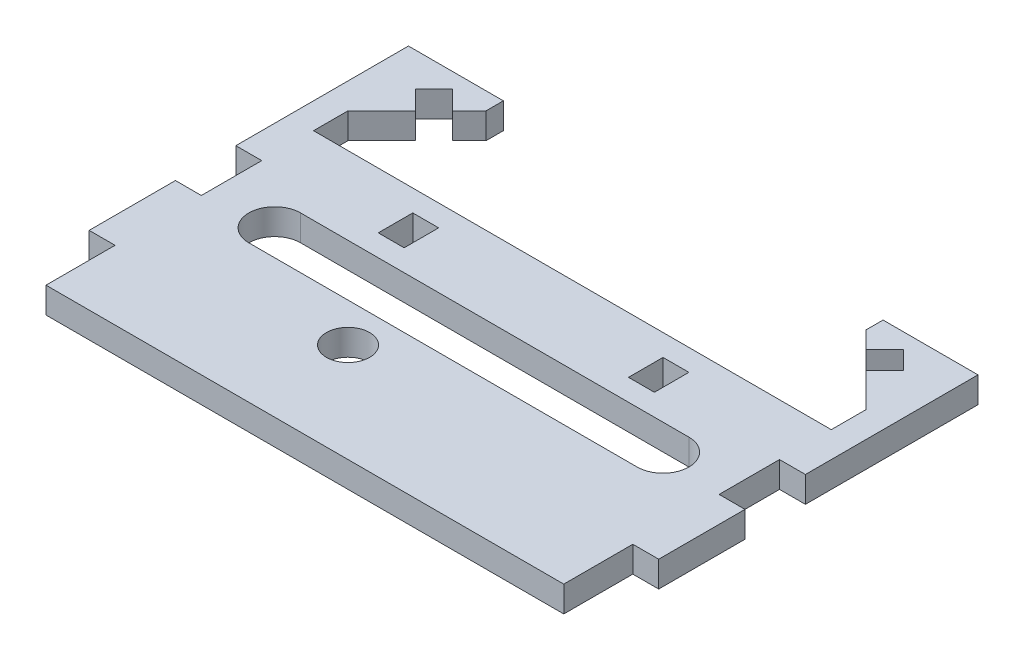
ISO-10303-21;
HEADER;
FILE_DESCRIPTION(('STEP AP214'),'2;1');
FILE_NAME('part.step','',(''),(''),'','','');
FILE_SCHEMA(('AUTOMOTIVE_DESIGN { 1 0 10303 214 1 1 1 1 }'));
ENDSEC;
DATA;
#1=APPLICATION_CONTEXT('core data for automotive mechanical design processes');
#2=APPLICATION_PROTOCOL_DEFINITION('international standard','automotive_design',2000,#1);
#3=PRODUCT_CONTEXT('',#1,'mechanical');
#4=PRODUCT('Part','Part','',(#3));
#5=PRODUCT_RELATED_PRODUCT_CATEGORY('part','',(#4));
#6=PRODUCT_DEFINITION_FORMATION('','',#4);
#7=PRODUCT_DEFINITION_CONTEXT('part definition',#1,'design');
#8=PRODUCT_DEFINITION('design','',#6,#7);
#9=PRODUCT_DEFINITION_SHAPE('','',#8);
#10=(LENGTH_UNIT() NAMED_UNIT(*) SI_UNIT(.MILLI.,.METRE.));
#11=(NAMED_UNIT(*) PLANE_ANGLE_UNIT() SI_UNIT($,.RADIAN.));
#12=(NAMED_UNIT(*) SI_UNIT($,.STERADIAN.) SOLID_ANGLE_UNIT());
#13=UNCERTAINTY_MEASURE_WITH_UNIT(LENGTH_MEASURE(1.E-05),#10,'distance_accuracy_value','');
#14=(GEOMETRIC_REPRESENTATION_CONTEXT(3) GLOBAL_UNCERTAINTY_ASSIGNED_CONTEXT((#13)) GLOBAL_UNIT_ASSIGNED_CONTEXT((#10,
#11,#12)) REPRESENTATION_CONTEXT('',''));
#15=CARTESIAN_POINT('',(0.,0.,0.));
#16=DIRECTION('',(0.,0.,1.));
#17=DIRECTION('',(1.,0.,0.));
#18=AXIS2_PLACEMENT_3D('',#15,#16,#17);
#19=CARTESIAN_POINT('',(30.,3.,18.));
#20=DIRECTION('',(0.,1.,0.));
#21=DIRECTION('',(0.,0.,1.));
#22=AXIS2_PLACEMENT_3D('',#19,#20,#21);
#23=PLANE('',#22);
#24=DIRECTION('',(-1.,0.,0.));
#25=VECTOR('',#24,1.);
#26=CARTESIAN_POINT('',(13.,3.,-10.5));
#27=LINE('',#26,#25);
#28=CARTESIAN_POINT('',(16.,3.,-10.5));
#29=VERTEX_POINT('',#28);
#30=CARTESIAN_POINT('',(13.,3.,-10.5));
#31=VERTEX_POINT('',#30);
#32=EDGE_CURVE('E355',#29,#31,#27,.T.);
#33=ORIENTED_EDGE('',*,*,#32,.F.);
#34=DIRECTION('',(0.,0.,-1.));
#35=VECTOR('',#34,1.);
#36=CARTESIAN_POINT('',(16.,3.,-10.5));
#37=LINE('',#36,#35);
#38=CARTESIAN_POINT('',(16.,3.,-6.50000000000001));
#39=VERTEX_POINT('',#38);
#40=EDGE_CURVE('E358',#39,#29,#37,.T.);
#41=ORIENTED_EDGE('',*,*,#40,.F.);
#42=DIRECTION('',(1.,0.,0.));
#43=VECTOR('',#42,1.);
#44=CARTESIAN_POINT('',(13.,3.,-6.50000000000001));
#45=LINE('',#44,#43);
#46=CARTESIAN_POINT('',(13.,3.,-6.50000000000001));
#47=VERTEX_POINT('',#46);
#48=EDGE_CURVE('E382',#47,#39,#45,.T.);
#49=ORIENTED_EDGE('',*,*,#48,.F.);
#50=DIRECTION('',(0.,0.,1.));
#51=VECTOR('',#50,1.);
#52=CARTESIAN_POINT('',(13.,3.,-10.5));
#53=LINE('',#52,#51);
#54=EDGE_CURVE('E333',#31,#47,#53,.T.);
#55=ORIENTED_EDGE('',*,*,#54,.F.);
#56=EDGE_LOOP('',(#33,#41,#49,#55));
#57=FACE_BOUND('',#56,.T.);
#58=DIRECTION('',(-0.707106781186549,0.,-0.707106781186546));
#59=VECTOR('',#58,1.);
#60=CARTESIAN_POINT('',(28.2731493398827,3.,-23.1109127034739));
#61=LINE('',#60,#59);
#62=CARTESIAN_POINT('',(28.2731493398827,3.,-23.1109127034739));
#63=VERTEX_POINT('',#62);
#64=CARTESIAN_POINT('',(26.151828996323,3.,-25.2322330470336));
#65=VERTEX_POINT('',#64);
#66=EDGE_CURVE('E420',#63,#65,#61,.T.);
#67=ORIENTED_EDGE('',*,*,#66,.F.);
#68=DIRECTION('',(0.707106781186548,0.,-0.707106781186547));
#69=VECTOR('',#68,1.);
#70=CARTESIAN_POINT('',(28.2731493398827,3.,-23.1109127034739));
#71=LINE('',#70,#69);
#72=CARTESIAN_POINT('',(26.0811183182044,3.,-20.9188816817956));
#73=VERTEX_POINT('',#72);
#74=EDGE_CURVE('E418',#73,#63,#71,.T.);
#75=ORIENTED_EDGE('',*,*,#74,.F.);
#76=DIRECTION('',(0.707106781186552,0.,0.707106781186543));
#77=VECTOR('',#76,1.);
#78=CARTESIAN_POINT('',(22.,3.,-24.9999999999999));
#79=LINE('',#78,#77);
#80=CARTESIAN_POINT('',(30.,3.,-17.));
#81=VERTEX_POINT('',#80);
#82=EDGE_CURVE('E478',#73,#81,#79,.T.);
#83=ORIENTED_EDGE('',*,*,#82,.T.);
#84=DIRECTION('',(0.,0.,1.));
#85=VECTOR('',#84,1.);
#86=CARTESIAN_POINT('',(30.,3.,-17.));
#87=LINE('',#86,#85);
#88=CARTESIAN_POINT('',(30.,3.,-13.));
#89=VERTEX_POINT('',#88);
#90=EDGE_CURVE('E482',#81,#89,#87,.T.);
#91=ORIENTED_EDGE('',*,*,#90,.T.);
#92=DIRECTION('',(1.,0.,0.));
#93=VECTOR('',#92,1.);
#94=CARTESIAN_POINT('',(-30.,3.,-13.));
#95=LINE('',#94,#93);
#96=CARTESIAN_POINT('',(-30.,3.,-13.));
#97=VERTEX_POINT('',#96);
#98=EDGE_CURVE('E563',#97,#89,#95,.T.);
#99=ORIENTED_EDGE('',*,*,#98,.F.);
#100=DIRECTION('',(0.,0.,-1.));
#101=VECTOR('',#100,1.);
#102=CARTESIAN_POINT('',(-30.,3.,-7.));
#103=LINE('',#102,#101);
#104=CARTESIAN_POINT('',(-30.,3.,-17.));
#105=VERTEX_POINT('',#104);
#106=EDGE_CURVE('E519',#97,#105,#103,.T.);
#107=ORIENTED_EDGE('',*,*,#106,.T.);
#108=DIRECTION('',(0.707106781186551,0.,-0.707106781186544));
#109=VECTOR('',#108,1.);
#110=CARTESIAN_POINT('',(-22.,3.,-24.9999999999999));
#111=LINE('',#110,#109);
#112=CARTESIAN_POINT('',(-26.0811183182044,3.,-20.9188816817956));
#113=VERTEX_POINT('',#112);
#114=EDGE_CURVE('E523',#105,#113,#111,.T.);
#115=ORIENTED_EDGE('',*,*,#114,.T.);
#116=DIRECTION('',(0.707106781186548,0.,0.707106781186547));
#117=VECTOR('',#116,1.);
#118=CARTESIAN_POINT('',(-28.2731493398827,3.,-23.1109127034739));
#119=LINE('',#118,#117);
#120=CARTESIAN_POINT('',(-28.2731493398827,3.,-23.1109127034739));
#121=VERTEX_POINT('',#120);
#122=EDGE_CURVE('E445',#121,#113,#119,.T.);
#123=ORIENTED_EDGE('',*,*,#122,.F.);
#124=DIRECTION('',(-0.707106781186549,0.,0.707106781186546));
#125=VECTOR('',#124,1.);
#126=CARTESIAN_POINT('',(-28.2731493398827,3.,-23.1109127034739));
#127=LINE('',#126,#125);
#128=CARTESIAN_POINT('',(-26.151828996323,3.,-25.2322330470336));
#129=VERTEX_POINT('',#128);
#130=EDGE_CURVE('E443',#129,#121,#127,.T.);
#131=ORIENTED_EDGE('',*,*,#130,.F.);
#132=DIRECTION('',(-0.707106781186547,0.,-0.707106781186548));
#133=VECTOR('',#132,1.);
#134=CARTESIAN_POINT('',(-26.151828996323,3.,-25.2322330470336));
#135=LINE('',#134,#133);
#136=CARTESIAN_POINT('',(-23.9597979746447,3.,-23.0402020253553));
#137=VERTEX_POINT('',#136);
#138=EDGE_CURVE('E448',#137,#129,#135,.T.);
#139=ORIENTED_EDGE('',*,*,#138,.F.);
#140=CARTESIAN_POINT('',(-22.,3.,-24.9999999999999));
#141=VERTEX_POINT('',#140);
#142=EDGE_CURVE('E522',#137,#141,#111,.T.);
#143=ORIENTED_EDGE('',*,*,#142,.T.);
#144=DIRECTION('',(0.,0.,-1.));
#145=VECTOR('',#144,1.);
#146=CARTESIAN_POINT('',(-22.,3.,-26.9999999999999));
#147=LINE('',#146,#145);
#148=CARTESIAN_POINT('',(-22.,3.,-26.9999999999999));
#149=VERTEX_POINT('',#148);
#150=EDGE_CURVE('E526',#141,#149,#147,.T.);
#151=ORIENTED_EDGE('',*,*,#150,.T.);
#152=DIRECTION('',(-1.,0.,0.));
#153=VECTOR('',#152,1.);
#154=CARTESIAN_POINT('',(-33.,3.,-26.9999999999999));
#155=LINE('',#154,#153);
#156=CARTESIAN_POINT('',(-33.,3.,-26.9999999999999));
#157=VERTEX_POINT('',#156);
#158=EDGE_CURVE('E528',#149,#157,#155,.T.);
#159=ORIENTED_EDGE('',*,*,#158,.T.);
#160=DIRECTION('',(0.,0.,1.));
#161=VECTOR('',#160,1.);
#162=CARTESIAN_POINT('',(-33.,3.,-7.));
#163=LINE('',#162,#161);
#164=CARTESIAN_POINT('',(-33.,3.,-7.));
#165=VERTEX_POINT('',#164);
#166=EDGE_CURVE('E530',#157,#165,#163,.T.);
#167=ORIENTED_EDGE('',*,*,#166,.T.);
#168=DIRECTION('',(1.,0.,0.));
#169=VECTOR('',#168,1.);
#170=CARTESIAN_POINT('',(-33.,3.,-7.));
#171=LINE('',#170,#169);
#172=CARTESIAN_POINT('',(-30.,3.,-7.00000000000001));
#173=VERTEX_POINT('',#172);
#174=EDGE_CURVE('E516',#165,#173,#171,.T.);
#175=ORIENTED_EDGE('',*,*,#174,.T.);
#176=DIRECTION('',(0.,0.,1.));
#177=VECTOR('',#176,1.);
#178=CARTESIAN_POINT('',(-30.,3.,-18.));
#179=LINE('',#178,#177);
#180=CARTESIAN_POINT('',(-30.,3.,0.));
#181=VERTEX_POINT('',#180);
#182=EDGE_CURVE('E39',#173,#181,#179,.T.);
#183=ORIENTED_EDGE('',*,*,#182,.T.);
#184=DIRECTION('',(-1.,0.,0.));
#185=VECTOR('',#184,1.);
#186=CARTESIAN_POINT('',(-33.,3.,0.));
#187=LINE('',#186,#185);
#188=CARTESIAN_POINT('',(-33.,3.,0.));
#189=VERTEX_POINT('',#188);
#190=EDGE_CURVE('E637',#181,#189,#187,.T.);
#191=ORIENTED_EDGE('',*,*,#190,.T.);
#192=DIRECTION('',(0.,0.,1.));
#193=VECTOR('',#192,1.);
#194=CARTESIAN_POINT('',(-33.,3.,0.));
#195=LINE('',#194,#193);
#196=CARTESIAN_POINT('',(-33.,3.,10.));
#197=VERTEX_POINT('',#196);
#198=EDGE_CURVE('E650',#189,#197,#195,.T.);
#199=ORIENTED_EDGE('',*,*,#198,.T.);
#200=DIRECTION('',(1.,0.,0.));
#201=VECTOR('',#200,1.);
#202=CARTESIAN_POINT('',(-33.,3.,10.));
#203=LINE('',#202,#201);
#204=CARTESIAN_POINT('',(-30.,3.,10.));
#205=VERTEX_POINT('',#204);
#206=EDGE_CURVE('E796',#197,#205,#203,.T.);
#207=ORIENTED_EDGE('',*,*,#206,.T.);
#208=CARTESIAN_POINT('',(-30.,3.,18.));
#209=VERTEX_POINT('',#208);
#210=EDGE_CURVE('E617',#205,#209,#179,.T.);
#211=ORIENTED_EDGE('',*,*,#210,.T.);
#212=DIRECTION('',(1.,0.,0.));
#213=VECTOR('',#212,1.);
#214=CARTESIAN_POINT('',(-30.,3.,18.));
#215=LINE('',#214,#213);
#216=CARTESIAN_POINT('',(30.,3.,18.));
#217=VERTEX_POINT('',#216);
#218=EDGE_CURVE('E627',#209,#217,#215,.T.);
#219=ORIENTED_EDGE('',*,*,#218,.T.);
#220=DIRECTION('',(0.,0.,-1.));
#221=VECTOR('',#220,1.);
#222=CARTESIAN_POINT('',(30.,3.,-18.));
#223=LINE('',#222,#221);
#224=CARTESIAN_POINT('',(30.,3.,10.));
#225=VERTEX_POINT('',#224);
#226=EDGE_CURVE('E619',#217,#225,#223,.T.);
#227=ORIENTED_EDGE('',*,*,#226,.T.);
#228=DIRECTION('',(1.,0.,0.));
#229=VECTOR('',#228,1.);
#230=CARTESIAN_POINT('',(33.,3.,10.));
#231=LINE('',#230,#229);
#232=CARTESIAN_POINT('',(33.,3.,10.));
#233=VERTEX_POINT('',#232);
#234=EDGE_CURVE('E587',#225,#233,#231,.T.);
#235=ORIENTED_EDGE('',*,*,#234,.T.);
#236=DIRECTION('',(0.,0.,-1.));
#237=VECTOR('',#236,1.);
#238=CARTESIAN_POINT('',(33.,3.,0.));
#239=LINE('',#238,#237);
#240=CARTESIAN_POINT('',(33.,3.,0.));
#241=VERTEX_POINT('',#240);
#242=EDGE_CURVE('E575',#233,#241,#239,.T.);
#243=ORIENTED_EDGE('',*,*,#242,.T.);
#244=DIRECTION('',(-1.,0.,0.));
#245=VECTOR('',#244,1.);
#246=CARTESIAN_POINT('',(33.,3.,0.));
#247=LINE('',#246,#245);
#248=CARTESIAN_POINT('',(30.,3.,0.));
#249=VERTEX_POINT('',#248);
#250=EDGE_CURVE('E578',#241,#249,#247,.T.);
#251=ORIENTED_EDGE('',*,*,#250,.T.);
#252=CARTESIAN_POINT('',(30.,3.,-7.));
#253=VERTEX_POINT('',#252);
#254=EDGE_CURVE('E685',#249,#253,#223,.T.);
#255=ORIENTED_EDGE('',*,*,#254,.T.);
#256=DIRECTION('',(1.,0.,0.));
#257=VECTOR('',#256,1.);
#258=CARTESIAN_POINT('',(33.,3.,-7.));
#259=LINE('',#258,#257);
#260=CARTESIAN_POINT('',(33.,3.,-7.));
#261=VERTEX_POINT('',#260);
#262=EDGE_CURVE('E468',#253,#261,#259,.T.);
#263=ORIENTED_EDGE('',*,*,#262,.T.);
#264=DIRECTION('',(0.,0.,-1.));
#265=VECTOR('',#264,1.);
#266=CARTESIAN_POINT('',(33.,3.,-7.));
#267=LINE('',#266,#265);
#268=CARTESIAN_POINT('',(33.,3.,-26.9999999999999));
#269=VERTEX_POINT('',#268);
#270=EDGE_CURVE('E471',#261,#269,#267,.T.);
#271=ORIENTED_EDGE('',*,*,#270,.T.);
#272=DIRECTION('',(-1.,0.,0.));
#273=VECTOR('',#272,1.);
#274=CARTESIAN_POINT('',(33.,3.,-26.9999999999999));
#275=LINE('',#274,#273);
#276=CARTESIAN_POINT('',(22.,3.,-26.9999999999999));
#277=VERTEX_POINT('',#276);
#278=EDGE_CURVE('E474',#269,#277,#275,.T.);
#279=ORIENTED_EDGE('',*,*,#278,.T.);
#280=DIRECTION('',(0.,0.,1.));
#281=VECTOR('',#280,1.);
#282=CARTESIAN_POINT('',(22.,3.,-26.9999999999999));
#283=LINE('',#282,#281);
#284=CARTESIAN_POINT('',(22.,3.,-24.9999999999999));
#285=VERTEX_POINT('',#284);
#286=EDGE_CURVE('E476',#277,#285,#283,.T.);
#287=ORIENTED_EDGE('',*,*,#286,.T.);
#288=CARTESIAN_POINT('',(23.9597979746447,3.,-23.0402020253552));
#289=VERTEX_POINT('',#288);
#290=EDGE_CURVE('E479',#285,#289,#79,.T.);
#291=ORIENTED_EDGE('',*,*,#290,.T.);
#292=DIRECTION('',(-0.707106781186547,0.,0.707106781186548));
#293=VECTOR('',#292,1.);
#294=CARTESIAN_POINT('',(26.151828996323,3.,-25.2322330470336));
#295=LINE('',#294,#293);
#296=EDGE_CURVE('E423',#65,#289,#295,.T.);
#297=ORIENTED_EDGE('',*,*,#296,.F.);
#298=EDGE_LOOP('',(#67,#75,#83,#91,#99,#107,#115,#123,#131,#139,#143,#151,#159,#167,#175,#183,
#191,#199,#207,#211,#219,#227,#235,#243,#251,#255,#263,#271,#279,#287,#291,#297));
#299=FACE_BOUND('',#298,.T.);
#300=CARTESIAN_POINT('',(-6.5,3.,6.5));
#301=DIRECTION('',(0.,1.,0.));
#302=DIRECTION('',(0.,0.,1.));
#303=AXIS2_PLACEMENT_3D('',#300,#301,#302);
#304=CIRCLE('',#303,2.5);
#305=CARTESIAN_POINT('',(-6.5,3.,9.));
#306=VERTEX_POINT('',#305);
#307=EDGE_CURVE('E659',#306,#306,#304,.T.);
#308=ORIENTED_EDGE('',*,*,#307,.F.);
#309=EDGE_LOOP('',(#308));
#310=FACE_BOUND('',#309,.T.);
#311=DIRECTION('',(1.,0.,0.));
#312=VECTOR('',#311,1.);
#313=CARTESIAN_POINT('',(-22.5,3.,1.99999999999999));
#314=LINE('',#313,#312);
#315=CARTESIAN_POINT('',(-22.5,3.,1.99999999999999));
#316=VERTEX_POINT('',#315);
#317=CARTESIAN_POINT('',(22.5,3.,1.99999999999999));
#318=VERTEX_POINT('',#317);
#319=EDGE_CURVE('E387',#316,#318,#314,.T.);
#320=ORIENTED_EDGE('',*,*,#319,.F.);
#321=CARTESIAN_POINT('',(-22.5,3.,-1.00000000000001));
#322=DIRECTION('',(0.,1.,0.));
#323=DIRECTION('',(0.,0.,1.));
#324=AXIS2_PLACEMENT_3D('',#321,#322,#323);
#325=CIRCLE('',#324,3.);
#326=CARTESIAN_POINT('',(-22.5,3.,-4.00000000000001));
#327=VERTEX_POINT('',#326);
#328=EDGE_CURVE('E390',#327,#316,#325,.T.);
#329=ORIENTED_EDGE('',*,*,#328,.F.);
#330=DIRECTION('',(-1.,0.,0.));
#331=VECTOR('',#330,1.);
#332=CARTESIAN_POINT('',(-22.5,3.,-4.00000000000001));
#333=LINE('',#332,#331);
#334=CARTESIAN_POINT('',(22.5,3.,-4.00000000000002));
#335=VERTEX_POINT('',#334);
#336=EDGE_CURVE('E414',#335,#327,#333,.T.);
#337=ORIENTED_EDGE('',*,*,#336,.F.);
#338=CARTESIAN_POINT('',(22.5,3.,-1.00000000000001));
#339=DIRECTION('',(0.,1.,0.));
#340=DIRECTION('',(0.,0.,1.));
#341=AXIS2_PLACEMENT_3D('',#338,#339,#340);
#342=CIRCLE('',#341,3.);
#343=EDGE_CURVE('E385',#318,#335,#342,.T.);
#344=ORIENTED_EDGE('',*,*,#343,.F.);
#345=EDGE_LOOP('',(#320,#329,#337,#344));
#346=FACE_BOUND('',#345,.T.);
#347=DIRECTION('',(-1.,0.,0.));
#348=VECTOR('',#347,1.);
#349=CARTESIAN_POINT('',(-16.,3.,-10.5));
#350=LINE('',#349,#348);
#351=CARTESIAN_POINT('',(-13.,3.,-10.5));
#352=VERTEX_POINT('',#351);
#353=CARTESIAN_POINT('',(-16.,3.,-10.5));
#354=VERTEX_POINT('',#353);
#355=EDGE_CURVE('E337',#352,#354,#350,.T.);
#356=ORIENTED_EDGE('',*,*,#355,.F.);
#357=DIRECTION('',(0.,0.,-1.));
#358=VECTOR('',#357,1.);
#359=CARTESIAN_POINT('',(-13.,3.,-10.5));
#360=LINE('',#359,#358);
#361=CARTESIAN_POINT('',(-13.,3.,-6.50000000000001));
#362=VERTEX_POINT('',#361);
#363=EDGE_CURVE('E321',#362,#352,#360,.T.);
#364=ORIENTED_EDGE('',*,*,#363,.F.);
#365=DIRECTION('',(1.,0.,0.));
#366=VECTOR('',#365,1.);
#367=CARTESIAN_POINT('',(-16.,3.,-6.50000000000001));
#368=LINE('',#367,#366);
#369=CARTESIAN_POINT('',(-16.,3.,-6.50000000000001));
#370=VERTEX_POINT('',#369);
#371=EDGE_CURVE('E330',#370,#362,#368,.T.);
#372=ORIENTED_EDGE('',*,*,#371,.F.);
#373=DIRECTION('',(0.,0.,1.));
#374=VECTOR('',#373,1.);
#375=CARTESIAN_POINT('',(-16.,3.,-10.5));
#376=LINE('',#375,#374);
#377=EDGE_CURVE('E53',#354,#370,#376,.T.);
#378=ORIENTED_EDGE('',*,*,#377,.F.);
#379=EDGE_LOOP('',(#356,#364,#372,#378));
#380=FACE_BOUND('',#379,.T.);
#381=ADVANCED_FACE('F35',(#57,#299,#310,#346,#380),#23,.T.);
#382=CARTESIAN_POINT('',(30.,0.,18.));
#383=DIRECTION('',(0.,1.,0.));
#384=DIRECTION('',(0.,0.,1.));
#385=AXIS2_PLACEMENT_3D('',#382,#383,#384);
#386=PLANE('',#385);
#387=DIRECTION('',(0.,0.,-1.));
#388=VECTOR('',#387,1.);
#389=CARTESIAN_POINT('',(16.,0.,-10.5));
#390=LINE('',#389,#388);
#391=CARTESIAN_POINT('',(16.,0.,-6.50000000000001));
#392=VERTEX_POINT('',#391);
#393=CARTESIAN_POINT('',(16.,0.,-10.5));
#394=VERTEX_POINT('',#393);
#395=EDGE_CURVE('E361',#392,#394,#390,.T.);
#396=ORIENTED_EDGE('',*,*,#395,.T.);
#397=DIRECTION('',(-1.,0.,0.));
#398=VECTOR('',#397,1.);
#399=CARTESIAN_POINT('',(13.,0.,-10.5));
#400=LINE('',#399,#398);
#401=CARTESIAN_POINT('',(13.,0.,-10.5));
#402=VERTEX_POINT('',#401);
#403=EDGE_CURVE('E364',#394,#402,#400,.T.);
#404=ORIENTED_EDGE('',*,*,#403,.T.);
#405=DIRECTION('',(0.,0.,1.));
#406=VECTOR('',#405,1.);
#407=CARTESIAN_POINT('',(13.,0.,-10.5));
#408=LINE('',#407,#406);
#409=CARTESIAN_POINT('',(13.,0.,-6.50000000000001));
#410=VERTEX_POINT('',#409);
#411=EDGE_CURVE('E367',#402,#410,#408,.T.);
#412=ORIENTED_EDGE('',*,*,#411,.T.);
#413=DIRECTION('',(1.,0.,0.));
#414=VECTOR('',#413,1.);
#415=CARTESIAN_POINT('',(13.,0.,-6.50000000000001));
#416=LINE('',#415,#414);
#417=EDGE_CURVE('E370',#410,#392,#416,.T.);
#418=ORIENTED_EDGE('',*,*,#417,.T.);
#419=EDGE_LOOP('',(#396,#404,#412,#418));
#420=FACE_BOUND('',#419,.T.);
#421=DIRECTION('',(0.707106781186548,0.,-0.707106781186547));
#422=VECTOR('',#421,1.);
#423=CARTESIAN_POINT('',(28.2731493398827,0.,-23.1109127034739));
#424=LINE('',#423,#422);
#425=CARTESIAN_POINT('',(26.0811183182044,0.,-20.9188816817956));
#426=VERTEX_POINT('',#425);
#427=CARTESIAN_POINT('',(28.2731493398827,0.,-23.1109127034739));
#428=VERTEX_POINT('',#427);
#429=EDGE_CURVE('E417',#426,#428,#424,.T.);
#430=ORIENTED_EDGE('',*,*,#429,.T.);
#431=DIRECTION('',(-0.707106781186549,0.,-0.707106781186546));
#432=VECTOR('',#431,1.);
#433=CARTESIAN_POINT('',(28.2731493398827,0.,-23.1109127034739));
#434=LINE('',#433,#432);
#435=CARTESIAN_POINT('',(26.151828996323,0.,-25.2322330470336));
#436=VERTEX_POINT('',#435);
#437=EDGE_CURVE('E428',#428,#436,#434,.T.);
#438=ORIENTED_EDGE('',*,*,#437,.T.);
#439=DIRECTION('',(-0.707106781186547,0.,0.707106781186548));
#440=VECTOR('',#439,1.);
#441=CARTESIAN_POINT('',(26.151828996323,0.,-25.2322330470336));
#442=LINE('',#441,#440);
#443=CARTESIAN_POINT('',(23.9597979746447,0.,-23.0402020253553));
#444=VERTEX_POINT('',#443);
#445=EDGE_CURVE('E421',#436,#444,#442,.T.);
#446=ORIENTED_EDGE('',*,*,#445,.T.);
#447=DIRECTION('',(0.707106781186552,0.,0.707106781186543));
#448=VECTOR('',#447,1.);
#449=CARTESIAN_POINT('',(22.,0.,-24.9999999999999));
#450=LINE('',#449,#448);
#451=CARTESIAN_POINT('',(22.,0.,-24.9999999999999));
#452=VERTEX_POINT('',#451);
#453=EDGE_CURVE('E495',#452,#444,#450,.T.);
#454=ORIENTED_EDGE('',*,*,#453,.F.);
#455=DIRECTION('',(0.,0.,1.));
#456=VECTOR('',#455,1.);
#457=CARTESIAN_POINT('',(22.,0.,-26.9999999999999));
#458=LINE('',#457,#456);
#459=CARTESIAN_POINT('',(22.,0.,-26.9999999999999));
#460=VERTEX_POINT('',#459);
#461=EDGE_CURVE('E492',#460,#452,#458,.T.);
#462=ORIENTED_EDGE('',*,*,#461,.F.);
#463=DIRECTION('',(-1.,0.,0.));
#464=VECTOR('',#463,1.);
#465=CARTESIAN_POINT('',(33.,0.,-26.9999999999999));
#466=LINE('',#465,#464);
#467=CARTESIAN_POINT('',(33.,0.,-26.9999999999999));
#468=VERTEX_POINT('',#467);
#469=EDGE_CURVE('E490',#468,#460,#466,.T.);
#470=ORIENTED_EDGE('',*,*,#469,.F.);
#471=DIRECTION('',(0.,0.,-1.));
#472=VECTOR('',#471,1.);
#473=CARTESIAN_POINT('',(33.,0.,-7.));
#474=LINE('',#473,#472);
#475=CARTESIAN_POINT('',(33.,0.,-7.));
#476=VERTEX_POINT('',#475);
#477=EDGE_CURVE('E488',#476,#468,#474,.T.);
#478=ORIENTED_EDGE('',*,*,#477,.F.);
#479=DIRECTION('',(1.,0.,0.));
#480=VECTOR('',#479,1.);
#481=CARTESIAN_POINT('',(33.,0.,-7.));
#482=LINE('',#481,#480);
#483=CARTESIAN_POINT('',(30.,0.,-7.));
#484=VERTEX_POINT('',#483);
#485=EDGE_CURVE('E467',#484,#476,#482,.T.);
#486=ORIENTED_EDGE('',*,*,#485,.F.);
#487=DIRECTION('',(0.,0.,-1.));
#488=VECTOR('',#487,1.);
#489=CARTESIAN_POINT('',(30.,0.,-18.));
#490=LINE('',#489,#488);
#491=CARTESIAN_POINT('',(30.,0.,0.));
#492=VERTEX_POINT('',#491);
#493=EDGE_CURVE('E672',#492,#484,#490,.T.);
#494=ORIENTED_EDGE('',*,*,#493,.F.);
#495=DIRECTION('',(-1.,0.,0.));
#496=VECTOR('',#495,1.);
#497=CARTESIAN_POINT('',(33.,0.,0.));
#498=LINE('',#497,#496);
#499=CARTESIAN_POINT('',(33.,0.,0.));
#500=VERTEX_POINT('',#499);
#501=EDGE_CURVE('E582',#500,#492,#498,.T.);
#502=ORIENTED_EDGE('',*,*,#501,.F.);
#503=DIRECTION('',(0.,0.,-1.));
#504=VECTOR('',#503,1.);
#505=CARTESIAN_POINT('',(33.,0.,0.));
#506=LINE('',#505,#504);
#507=CARTESIAN_POINT('',(33.,0.,10.));
#508=VERTEX_POINT('',#507);
#509=EDGE_CURVE('E574',#508,#500,#506,.T.);
#510=ORIENTED_EDGE('',*,*,#509,.F.);
#511=DIRECTION('',(1.,0.,0.));
#512=VECTOR('',#511,1.);
#513=CARTESIAN_POINT('',(33.,0.,10.));
#514=LINE('',#513,#512);
#515=CARTESIAN_POINT('',(30.,0.,10.));
#516=VERTEX_POINT('',#515);
#517=EDGE_CURVE('E579',#516,#508,#514,.T.);
#518=ORIENTED_EDGE('',*,*,#517,.F.);
#519=CARTESIAN_POINT('',(30.,0.,18.));
#520=VERTEX_POINT('',#519);
#521=EDGE_CURVE('E616',#520,#516,#490,.T.);
#522=ORIENTED_EDGE('',*,*,#521,.F.);
#523=DIRECTION('',(1.,0.,0.));
#524=VECTOR('',#523,1.);
#525=CARTESIAN_POINT('',(-30.,0.,18.));
#526=LINE('',#525,#524);
#527=CARTESIAN_POINT('',(-30.,0.,18.));
#528=VERTEX_POINT('',#527);
#529=EDGE_CURVE('E605',#528,#520,#526,.T.);
#530=ORIENTED_EDGE('',*,*,#529,.F.);
#531=DIRECTION('',(0.,0.,1.));
#532=VECTOR('',#531,1.);
#533=CARTESIAN_POINT('',(-30.,0.,-18.));
#534=LINE('',#533,#532);
#535=CARTESIAN_POINT('',(-30.,0.,10.));
#536=VERTEX_POINT('',#535);
#537=EDGE_CURVE('E606',#536,#528,#534,.T.);
#538=ORIENTED_EDGE('',*,*,#537,.F.);
#539=DIRECTION('',(1.,0.,0.));
#540=VECTOR('',#539,1.);
#541=CARTESIAN_POINT('',(-33.,0.,10.));
#542=LINE('',#541,#540);
#543=CARTESIAN_POINT('',(-33.,0.,10.));
#544=VERTEX_POINT('',#543);
#545=EDGE_CURVE('E651',#544,#536,#542,.T.);
#546=ORIENTED_EDGE('',*,*,#545,.F.);
#547=DIRECTION('',(0.,0.,1.));
#548=VECTOR('',#547,1.);
#549=CARTESIAN_POINT('',(-33.,0.,0.));
#550=LINE('',#549,#548);
#551=CARTESIAN_POINT('',(-33.,0.,0.));
#552=VERTEX_POINT('',#551);
#553=EDGE_CURVE('E793',#552,#544,#550,.T.);
#554=ORIENTED_EDGE('',*,*,#553,.F.);
#555=DIRECTION('',(-1.,0.,0.));
#556=VECTOR('',#555,1.);
#557=CARTESIAN_POINT('',(-33.,0.,0.));
#558=LINE('',#557,#556);
#559=CARTESIAN_POINT('',(-30.,0.,0.));
#560=VERTEX_POINT('',#559);
#561=EDGE_CURVE('E666',#560,#552,#558,.T.);
#562=ORIENTED_EDGE('',*,*,#561,.F.);
#563=CARTESIAN_POINT('',(-30.,0.,-7.00000000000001));
#564=VERTEX_POINT('',#563);
#565=EDGE_CURVE('E603',#564,#560,#534,.T.);
#566=ORIENTED_EDGE('',*,*,#565,.F.);
#567=DIRECTION('',(1.,0.,0.));
#568=VECTOR('',#567,1.);
#569=CARTESIAN_POINT('',(-33.,0.,-7.));
#570=LINE('',#569,#568);
#571=CARTESIAN_POINT('',(-33.,0.,-7.));
#572=VERTEX_POINT('',#571);
#573=EDGE_CURVE('E515',#572,#564,#570,.T.);
#574=ORIENTED_EDGE('',*,*,#573,.F.);
#575=DIRECTION('',(0.,0.,1.));
#576=VECTOR('',#575,1.);
#577=CARTESIAN_POINT('',(-33.,0.,-7.));
#578=LINE('',#577,#576);
#579=CARTESIAN_POINT('',(-33.,0.,-26.9999999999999));
#580=VERTEX_POINT('',#579);
#581=EDGE_CURVE('E520',#580,#572,#578,.T.);
#582=ORIENTED_EDGE('',*,*,#581,.F.);
#583=DIRECTION('',(-1.,0.,0.));
#584=VECTOR('',#583,1.);
#585=CARTESIAN_POINT('',(-33.,0.,-26.9999999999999));
#586=LINE('',#585,#584);
#587=CARTESIAN_POINT('',(-22.,0.,-26.9999999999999));
#588=VERTEX_POINT('',#587);
#589=EDGE_CURVE('E543',#588,#580,#586,.T.);
#590=ORIENTED_EDGE('',*,*,#589,.F.);
#591=DIRECTION('',(0.,0.,-1.));
#592=VECTOR('',#591,1.);
#593=CARTESIAN_POINT('',(-22.,0.,-26.9999999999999));
#594=LINE('',#593,#592);
#595=CARTESIAN_POINT('',(-22.,0.,-24.9999999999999));
#596=VERTEX_POINT('',#595);
#597=EDGE_CURVE('E541',#596,#588,#594,.T.);
#598=ORIENTED_EDGE('',*,*,#597,.F.);
#599=DIRECTION('',(0.707106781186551,0.,-0.707106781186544));
#600=VECTOR('',#599,1.);
#601=CARTESIAN_POINT('',(-22.,0.,-24.9999999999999));
#602=LINE('',#601,#600);
#603=CARTESIAN_POINT('',(-23.9597979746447,0.,-23.0402020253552));
#604=VERTEX_POINT('',#603);
#605=EDGE_CURVE('E537',#604,#596,#602,.T.);
#606=ORIENTED_EDGE('',*,*,#605,.F.);
#607=DIRECTION('',(-0.707106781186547,0.,-0.707106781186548));
#608=VECTOR('',#607,1.);
#609=CARTESIAN_POINT('',(-26.151828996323,0.,-25.2322330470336));
#610=LINE('',#609,#608);
#611=CARTESIAN_POINT('',(-26.151828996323,0.,-25.2322330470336));
#612=VERTEX_POINT('',#611);
#613=EDGE_CURVE('E446',#604,#612,#610,.T.);
#614=ORIENTED_EDGE('',*,*,#613,.T.);
#615=DIRECTION('',(-0.707106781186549,0.,0.707106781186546));
#616=VECTOR('',#615,1.);
#617=CARTESIAN_POINT('',(-28.2731493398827,0.,-23.1109127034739));
#618=LINE('',#617,#616);
#619=CARTESIAN_POINT('',(-28.2731493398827,0.,-23.1109127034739));
#620=VERTEX_POINT('',#619);
#621=EDGE_CURVE('E442',#612,#620,#618,.T.);
#622=ORIENTED_EDGE('',*,*,#621,.T.);
#623=DIRECTION('',(0.707106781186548,0.,0.707106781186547));
#624=VECTOR('',#623,1.);
#625=CARTESIAN_POINT('',(-28.2731493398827,0.,-23.1109127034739));
#626=LINE('',#625,#624);
#627=CARTESIAN_POINT('',(-26.0811183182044,0.,-20.9188816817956));
#628=VERTEX_POINT('',#627);
#629=EDGE_CURVE('E453',#620,#628,#626,.T.);
#630=ORIENTED_EDGE('',*,*,#629,.T.);
#631=CARTESIAN_POINT('',(-30.,0.,-17.));
#632=VERTEX_POINT('',#631);
#633=EDGE_CURVE('E538',#632,#628,#602,.T.);
#634=ORIENTED_EDGE('',*,*,#633,.F.);
#635=DIRECTION('',(0.,0.,-1.));
#636=VECTOR('',#635,1.);
#637=CARTESIAN_POINT('',(-30.,0.,-17.));
#638=LINE('',#637,#636);
#639=CARTESIAN_POINT('',(-30.,0.,-13.));
#640=VERTEX_POINT('',#639);
#641=EDGE_CURVE('E535',#640,#632,#638,.T.);
#642=ORIENTED_EDGE('',*,*,#641,.F.);
#643=DIRECTION('',(1.,0.,0.));
#644=VECTOR('',#643,1.);
#645=CARTESIAN_POINT('',(-30.,0.,-13.));
#646=LINE('',#645,#644);
#647=CARTESIAN_POINT('',(30.,0.,-13.));
#648=VERTEX_POINT('',#647);
#649=EDGE_CURVE('E562',#640,#648,#646,.T.);
#650=ORIENTED_EDGE('',*,*,#649,.T.);
#651=DIRECTION('',(0.,0.,1.));
#652=VECTOR('',#651,1.);
#653=CARTESIAN_POINT('',(30.,0.,-7.));
#654=LINE('',#653,#652);
#655=CARTESIAN_POINT('',(30.,0.,-17.));
#656=VERTEX_POINT('',#655);
#657=EDGE_CURVE('E472',#656,#648,#654,.T.);
#658=ORIENTED_EDGE('',*,*,#657,.F.);
#659=EDGE_CURVE('E494',#426,#656,#450,.T.);
#660=ORIENTED_EDGE('',*,*,#659,.F.);
#661=EDGE_LOOP('',(#430,#438,#446,#454,#462,#470,#478,#486,#494,#502,#510,#518,#522,#530,#538,
#546,#554,#562,#566,#574,#582,#590,#598,#606,#614,#622,#630,#634,#642,#650,#658,#660));
#662=FACE_BOUND('',#661,.T.);
#663=CARTESIAN_POINT('',(-6.5,0.,6.5));
#664=DIRECTION('',(0.,1.,0.));
#665=DIRECTION('',(0.,0.,1.));
#666=AXIS2_PLACEMENT_3D('',#663,#664,#665);
#667=CIRCLE('',#666,2.5);
#668=CARTESIAN_POINT('',(-6.5,0.,9.));
#669=VERTEX_POINT('',#668);
#670=EDGE_CURVE('E656',#669,#669,#667,.T.);
#671=ORIENTED_EDGE('',*,*,#670,.T.);
#672=EDGE_LOOP('',(#671));
#673=FACE_BOUND('',#672,.T.);
#674=CARTESIAN_POINT('',(-22.5,0.,-1.00000000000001));
#675=DIRECTION('',(0.,1.,0.));
#676=DIRECTION('',(0.,0.,1.));
#677=AXIS2_PLACEMENT_3D('',#674,#675,#676);
#678=CIRCLE('',#677,3.);
#679=CARTESIAN_POINT('',(-22.5,0.,-4.00000000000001));
#680=VERTEX_POINT('',#679);
#681=CARTESIAN_POINT('',(-22.5,0.,1.99999999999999));
#682=VERTEX_POINT('',#681);
#683=EDGE_CURVE('E393',#680,#682,#678,.T.);
#684=ORIENTED_EDGE('',*,*,#683,.T.);
#685=DIRECTION('',(1.,0.,0.));
#686=VECTOR('',#685,1.);
#687=CARTESIAN_POINT('',(-22.5,0.,1.99999999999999));
#688=LINE('',#687,#686);
#689=CARTESIAN_POINT('',(22.5,0.,1.99999999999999));
#690=VERTEX_POINT('',#689);
#691=EDGE_CURVE('E396',#682,#690,#688,.T.);
#692=ORIENTED_EDGE('',*,*,#691,.T.);
#693=CARTESIAN_POINT('',(22.5,0.,-1.00000000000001));
#694=DIRECTION('',(0.,1.,0.));
#695=DIRECTION('',(0.,0.,1.));
#696=AXIS2_PLACEMENT_3D('',#693,#694,#695);
#697=CIRCLE('',#696,3.);
#698=CARTESIAN_POINT('',(22.5,0.,-4.00000000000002));
#699=VERTEX_POINT('',#698);
#700=EDGE_CURVE('E399',#690,#699,#697,.T.);
#701=ORIENTED_EDGE('',*,*,#700,.T.);
#702=DIRECTION('',(-1.,0.,0.));
#703=VECTOR('',#702,1.);
#704=CARTESIAN_POINT('',(-22.5,0.,-4.00000000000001));
#705=LINE('',#704,#703);
#706=EDGE_CURVE('E402',#699,#680,#705,.T.);
#707=ORIENTED_EDGE('',*,*,#706,.T.);
#708=EDGE_LOOP('',(#684,#692,#701,#707));
#709=FACE_BOUND('',#708,.T.);
#710=DIRECTION('',(0.,0.,-1.));
#711=VECTOR('',#710,1.);
#712=CARTESIAN_POINT('',(-13.,0.,-10.5));
#713=LINE('',#712,#711);
#714=CARTESIAN_POINT('',(-13.,0.,-6.50000000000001));
#715=VERTEX_POINT('',#714);
#716=CARTESIAN_POINT('',(-13.,0.,-10.5));
#717=VERTEX_POINT('',#716);
#718=EDGE_CURVE('E61',#715,#717,#713,.T.);
#719=ORIENTED_EDGE('',*,*,#718,.T.);
#720=DIRECTION('',(-1.,0.,0.));
#721=VECTOR('',#720,1.);
#722=CARTESIAN_POINT('',(-16.,0.,-10.5));
#723=LINE('',#722,#721);
#724=CARTESIAN_POINT('',(-16.,0.,-10.5));
#725=VERTEX_POINT('',#724);
#726=EDGE_CURVE('E339',#717,#725,#723,.T.);
#727=ORIENTED_EDGE('',*,*,#726,.T.);
#728=DIRECTION('',(0.,0.,1.));
#729=VECTOR('',#728,1.);
#730=CARTESIAN_POINT('',(-16.,0.,-10.5));
#731=LINE('',#730,#729);
#732=CARTESIAN_POINT('',(-16.,0.,-6.50000000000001));
#733=VERTEX_POINT('',#732);
#734=EDGE_CURVE('E346',#725,#733,#731,.T.);
#735=ORIENTED_EDGE('',*,*,#734,.T.);
#736=DIRECTION('',(1.,0.,0.));
#737=VECTOR('',#736,1.);
#738=CARTESIAN_POINT('',(-16.,0.,-6.50000000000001));
#739=LINE('',#738,#737);
#740=EDGE_CURVE('E327',#733,#715,#739,.T.);
#741=ORIENTED_EDGE('',*,*,#740,.T.);
#742=EDGE_LOOP('',(#719,#727,#735,#741));
#743=FACE_BOUND('',#742,.T.);
#744=ADVANCED_FACE('F704',(#420,#662,#673,#709,#743),#386,.F.);
#745=CARTESIAN_POINT('',(22.,3.,-24.9999999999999));
#746=DIRECTION('',(0.707106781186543,0.,-0.707106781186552));
#747=DIRECTION('',(-0.707106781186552,0.,-0.707106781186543));
#748=AXIS2_PLACEMENT_3D('',#745,#746,#747);
#749=PLANE('',#748);
#750=DIRECTION('',(0.,-1.,0.));
#751=VECTOR('',#750,1.);
#752=CARTESIAN_POINT('',(26.0811183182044,3.,-20.9188816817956));
#753=LINE('',#752,#751);
#754=EDGE_CURVE('E425',#73,#426,#753,.T.);
#755=ORIENTED_EDGE('',*,*,#754,.T.);
#756=ORIENTED_EDGE('',*,*,#659,.T.);
#757=DIRECTION('',(0.,-1.,0.));
#758=VECTOR('',#757,1.);
#759=CARTESIAN_POINT('',(30.,3.,-17.));
#760=LINE('',#759,#758);
#761=EDGE_CURVE('E500',#81,#656,#760,.T.);
#762=ORIENTED_EDGE('',*,*,#761,.F.);
#763=ORIENTED_EDGE('',*,*,#82,.F.);
#764=EDGE_LOOP('',(#755,#756,#762,#763));
#765=FACE_BOUND('',#764,.T.);
#766=ADVANCED_FACE('F739',(#765),#749,.F.);
#767=DIRECTION('',(0.,-1.,0.));
#768=VECTOR('',#767,1.);
#769=CARTESIAN_POINT('',(23.9597979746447,3.,-23.0402020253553));
#770=LINE('',#769,#768);
#771=EDGE_CURVE('E435',#289,#444,#770,.T.);
#772=ORIENTED_EDGE('',*,*,#771,.F.);
#773=ORIENTED_EDGE('',*,*,#290,.F.);
#774=DIRECTION('',(0.,-1.,0.));
#775=VECTOR('',#774,1.);
#776=CARTESIAN_POINT('',(22.,3.,-24.9999999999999));
#777=LINE('',#776,#775);
#778=EDGE_CURVE('E503',#285,#452,#777,.T.);
#779=ORIENTED_EDGE('',*,*,#778,.T.);
#780=ORIENTED_EDGE('',*,*,#453,.T.);
#781=EDGE_LOOP('',(#772,#773,#779,#780));
#782=FACE_BOUND('',#781,.T.);
#783=ADVANCED_FACE('F723',(#782),#749,.F.);
#784=CARTESIAN_POINT('',(-22.,3.,-24.9999999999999));
#785=DIRECTION('',(-0.707106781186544,0.,-0.707106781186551));
#786=DIRECTION('',(-0.707106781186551,0.,0.707106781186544));
#787=AXIS2_PLACEMENT_3D('',#784,#785,#786);
#788=PLANE('',#787);
#789=DIRECTION('',(0.,-1.,0.));
#790=VECTOR('',#789,1.);
#791=CARTESIAN_POINT('',(-26.0811183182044,3.,-20.9188816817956));
#792=LINE('',#791,#790);
#793=EDGE_CURVE('E462',#113,#628,#792,.T.);
#794=ORIENTED_EDGE('',*,*,#793,.F.);
#795=ORIENTED_EDGE('',*,*,#114,.F.);
#796=DIRECTION('',(0.,-1.,0.));
#797=VECTOR('',#796,1.);
#798=CARTESIAN_POINT('',(-30.,3.,-17.));
#799=LINE('',#798,#797);
#800=EDGE_CURVE('E557',#105,#632,#799,.T.);
#801=ORIENTED_EDGE('',*,*,#800,.T.);
#802=ORIENTED_EDGE('',*,*,#633,.T.);
#803=EDGE_LOOP('',(#794,#795,#801,#802));
#804=FACE_BOUND('',#803,.T.);
#805=ADVANCED_FACE('F754',(#804),#788,.F.);
#806=DIRECTION('',(0.,-1.,0.));
#807=VECTOR('',#806,1.);
#808=CARTESIAN_POINT('',(-23.9597979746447,3.,-23.0402020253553));
#809=LINE('',#808,#807);
#810=EDGE_CURVE('E459',#137,#604,#809,.T.);
#811=ORIENTED_EDGE('',*,*,#810,.T.);
#812=ORIENTED_EDGE('',*,*,#605,.T.);
#813=DIRECTION('',(0.,-1.,0.));
#814=VECTOR('',#813,1.);
#815=CARTESIAN_POINT('',(-22.,3.,-24.9999999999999));
#816=LINE('',#815,#814);
#817=EDGE_CURVE('E554',#141,#596,#816,.T.);
#818=ORIENTED_EDGE('',*,*,#817,.F.);
#819=ORIENTED_EDGE('',*,*,#142,.F.);
#820=EDGE_LOOP('',(#811,#812,#818,#819));
#821=FACE_BOUND('',#820,.T.);
#822=ADVANCED_FACE('F772',(#821),#788,.F.);
#823=CARTESIAN_POINT('',(30.,3.,-18.));
#824=DIRECTION('',(-1.,0.,0.));
#825=DIRECTION('',(0.,0.,1.));
#826=AXIS2_PLACEMENT_3D('',#823,#824,#825);
#827=PLANE('',#826);
#828=DIRECTION('',(0.,-1.,0.));
#829=VECTOR('',#828,1.);
#830=CARTESIAN_POINT('',(30.,3.,-7.));
#831=LINE('',#830,#829);
#832=EDGE_CURVE('E485',#253,#484,#831,.T.);
#833=ORIENTED_EDGE('',*,*,#832,.F.);
#834=ORIENTED_EDGE('',*,*,#254,.F.);
#835=DIRECTION('',(0.,-1.,0.));
#836=VECTOR('',#835,1.);
#837=CARTESIAN_POINT('',(30.,3.,0.));
#838=LINE('',#837,#836);
#839=EDGE_CURVE('E595',#249,#492,#838,.T.);
#840=ORIENTED_EDGE('',*,*,#839,.T.);
#841=ORIENTED_EDGE('',*,*,#493,.T.);
#842=EDGE_LOOP('',(#833,#834,#840,#841));
#843=FACE_BOUND('',#842,.T.);
#844=ADVANCED_FACE('F37',(#843),#827,.F.);
#845=CARTESIAN_POINT('',(-30.,3.,-18.));
#846=DIRECTION('',(1.,0.,0.));
#847=DIRECTION('',(0.,0.,-1.));
#848=AXIS2_PLACEMENT_3D('',#845,#846,#847);
#849=PLANE('',#848);
#850=DIRECTION('',(0.,-1.,0.));
#851=VECTOR('',#850,1.);
#852=CARTESIAN_POINT('',(-30.,3.,-7.));
#853=LINE('',#852,#851);
#854=EDGE_CURVE('E560',#173,#564,#853,.T.);
#855=ORIENTED_EDGE('',*,*,#854,.T.);
#856=ORIENTED_EDGE('',*,*,#565,.T.);
#857=DIRECTION('',(0.,-1.,0.));
#858=VECTOR('',#857,1.);
#859=CARTESIAN_POINT('',(-30.,3.,0.));
#860=LINE('',#859,#858);
#861=EDGE_CURVE('E646',#181,#560,#860,.T.);
#862=ORIENTED_EDGE('',*,*,#861,.F.);
#863=ORIENTED_EDGE('',*,*,#182,.F.);
#864=EDGE_LOOP('',(#855,#856,#862,#863));
#865=FACE_BOUND('',#864,.T.);
#866=ADVANCED_FACE('F653',(#865),#849,.F.);
#867=DIRECTION('',(0.,-1.,0.));
#868=VECTOR('',#867,1.);
#869=CARTESIAN_POINT('',(30.,3.,10.));
#870=LINE('',#869,#868);
#871=EDGE_CURVE('E586',#225,#516,#870,.T.);
#872=ORIENTED_EDGE('',*,*,#871,.F.);
#873=ORIENTED_EDGE('',*,*,#226,.F.);
#874=DIRECTION('',(0.,-1.,0.));
#875=VECTOR('',#874,1.);
#876=CARTESIAN_POINT('',(30.,3.,18.));
#877=LINE('',#876,#875);
#878=EDGE_CURVE('E45',#217,#520,#877,.T.);
#879=ORIENTED_EDGE('',*,*,#878,.T.);
#880=ORIENTED_EDGE('',*,*,#521,.T.);
#881=EDGE_LOOP('',(#872,#873,#879,#880));
#882=FACE_BOUND('',#881,.T.);
#883=ADVANCED_FACE('F822',(#882),#827,.F.);
#884=ORIENTED_EDGE('',*,*,#210,.F.);
#885=DIRECTION('',(0.,-1.,0.));
#886=VECTOR('',#885,1.);
#887=CARTESIAN_POINT('',(-30.,3.,10.));
#888=LINE('',#887,#886);
#889=EDGE_CURVE('E620',#205,#536,#888,.T.);
#890=ORIENTED_EDGE('',*,*,#889,.T.);
#891=ORIENTED_EDGE('',*,*,#537,.T.);
#892=DIRECTION('',(0.,-1.,0.));
#893=VECTOR('',#892,1.);
#894=CARTESIAN_POINT('',(-30.,3.,18.));
#895=LINE('',#894,#893);
#896=EDGE_CURVE('E11',#209,#528,#895,.T.);
#897=ORIENTED_EDGE('',*,*,#896,.F.);
#898=EDGE_LOOP('',(#884,#890,#891,#897));
#899=FACE_BOUND('',#898,.T.);
#900=ADVANCED_FACE('F816',(#899),#849,.F.);
#901=CARTESIAN_POINT('',(-30.,3.,18.));
#902=DIRECTION('',(0.,0.,-1.));
#903=DIRECTION('',(-1.,0.,0.));
#904=AXIS2_PLACEMENT_3D('',#901,#902,#903);
#905=PLANE('',#904);
#906=ORIENTED_EDGE('',*,*,#529,.T.);
#907=ORIENTED_EDGE('',*,*,#878,.F.);
#908=ORIENTED_EDGE('',*,*,#218,.F.);
#909=ORIENTED_EDGE('',*,*,#896,.T.);
#910=EDGE_LOOP('',(#906,#907,#908,#909));
#911=FACE_BOUND('',#910,.T.);
#912=ADVANCED_FACE('F818',(#911),#905,.F.);
#913=CARTESIAN_POINT('',(-6.5,3.,6.5));
#914=DIRECTION('',(0.,-1.,0.));
#915=DIRECTION('',(0.,0.,-1.));
#916=AXIS2_PLACEMENT_3D('',#913,#914,#915);
#917=CYLINDRICAL_SURFACE('',#916,2.5);
#918=ORIENTED_EDGE('',*,*,#307,.T.);
#919=EDGE_LOOP('',(#918));
#920=FACE_BOUND('',#919,.T.);
#921=ORIENTED_EDGE('',*,*,#670,.F.);
#922=EDGE_LOOP('',(#921));
#923=FACE_BOUND('',#922,.T.);
#924=ADVANCED_FACE('F849',(#920,#923),#917,.F.);
#925=CARTESIAN_POINT('',(-33.,3.,0.));
#926=DIRECTION('',(0.,0.,1.));
#927=DIRECTION('',(1.,0.,0.));
#928=AXIS2_PLACEMENT_3D('',#925,#926,#927);
#929=PLANE('',#928);
#930=ORIENTED_EDGE('',*,*,#561,.T.);
#931=DIRECTION('',(0.,-1.,0.));
#932=VECTOR('',#931,1.);
#933=CARTESIAN_POINT('',(-33.,3.,0.));
#934=LINE('',#933,#932);
#935=EDGE_CURVE('E648',#189,#552,#934,.T.);
#936=ORIENTED_EDGE('',*,*,#935,.F.);
#937=ORIENTED_EDGE('',*,*,#190,.F.);
#938=ORIENTED_EDGE('',*,*,#861,.T.);
#939=EDGE_LOOP('',(#930,#936,#937,#938));
#940=FACE_BOUND('',#939,.T.);
#941=ADVANCED_FACE('F645',(#940),#929,.F.);
#942=CARTESIAN_POINT('',(-33.,3.,0.));
#943=DIRECTION('',(1.,0.,0.));
#944=DIRECTION('',(0.,0.,-1.));
#945=AXIS2_PLACEMENT_3D('',#942,#943,#944);
#946=PLANE('',#945);
#947=ORIENTED_EDGE('',*,*,#553,.T.);
#948=DIRECTION('',(0.,-1.,0.));
#949=VECTOR('',#948,1.);
#950=CARTESIAN_POINT('',(-33.,3.,10.));
#951=LINE('',#950,#949);
#952=EDGE_CURVE('E660',#197,#544,#951,.T.);
#953=ORIENTED_EDGE('',*,*,#952,.F.);
#954=ORIENTED_EDGE('',*,*,#198,.F.);
#955=ORIENTED_EDGE('',*,*,#935,.T.);
#956=EDGE_LOOP('',(#947,#953,#954,#955));
#957=FACE_BOUND('',#956,.T.);
#958=ADVANCED_FACE('F837',(#957),#946,.F.);
#959=CARTESIAN_POINT('',(-33.,3.,10.));
#960=DIRECTION('',(0.,0.,-1.));
#961=DIRECTION('',(-1.,0.,0.));
#962=AXIS2_PLACEMENT_3D('',#959,#960,#961);
#963=PLANE('',#962);
#964=ORIENTED_EDGE('',*,*,#545,.T.);
#965=ORIENTED_EDGE('',*,*,#889,.F.);
#966=ORIENTED_EDGE('',*,*,#206,.F.);
#967=ORIENTED_EDGE('',*,*,#952,.T.);
#968=EDGE_LOOP('',(#964,#965,#966,#967));
#969=FACE_BOUND('',#968,.T.);
#970=ADVANCED_FACE('F812',(#969),#963,.F.);
#971=CARTESIAN_POINT('',(33.,3.,0.));
#972=DIRECTION('',(-1.,0.,0.));
#973=DIRECTION('',(0.,0.,1.));
#974=AXIS2_PLACEMENT_3D('',#971,#972,#973);
#975=PLANE('',#974);
#976=ORIENTED_EDGE('',*,*,#509,.T.);
#977=DIRECTION('',(0.,-1.,0.));
#978=VECTOR('',#977,1.);
#979=CARTESIAN_POINT('',(33.,3.,0.));
#980=LINE('',#979,#978);
#981=EDGE_CURVE('E689',#241,#500,#980,.T.);
#982=ORIENTED_EDGE('',*,*,#981,.F.);
#983=ORIENTED_EDGE('',*,*,#242,.F.);
#984=DIRECTION('',(0.,-1.,0.));
#985=VECTOR('',#984,1.);
#986=CARTESIAN_POINT('',(33.,3.,10.));
#987=LINE('',#986,#985);
#988=EDGE_CURVE('E583',#233,#508,#987,.T.);
#989=ORIENTED_EDGE('',*,*,#988,.T.);
#990=EDGE_LOOP('',(#976,#982,#983,#989));
#991=FACE_BOUND('',#990,.T.);
#992=ADVANCED_FACE('F829',(#991),#975,.F.);
#993=CARTESIAN_POINT('',(33.,3.,0.));
#994=DIRECTION('',(0.,0.,1.));
#995=DIRECTION('',(1.,0.,0.));
#996=AXIS2_PLACEMENT_3D('',#993,#994,#995);
#997=PLANE('',#996);
#998=ORIENTED_EDGE('',*,*,#501,.T.);
#999=ORIENTED_EDGE('',*,*,#839,.F.);
#1000=ORIENTED_EDGE('',*,*,#250,.F.);
#1001=ORIENTED_EDGE('',*,*,#981,.T.);
#1002=EDGE_LOOP('',(#998,#999,#1000,#1001));
#1003=FACE_BOUND('',#1002,.T.);
#1004=ADVANCED_FACE('F698',(#1003),#997,.F.);
#1005=CARTESIAN_POINT('',(33.,3.,10.));
#1006=DIRECTION('',(0.,0.,-1.));
#1007=DIRECTION('',(-1.,0.,0.));
#1008=AXIS2_PLACEMENT_3D('',#1005,#1006,#1007);
#1009=PLANE('',#1008);
#1010=ORIENTED_EDGE('',*,*,#517,.T.);
#1011=ORIENTED_EDGE('',*,*,#988,.F.);
#1012=ORIENTED_EDGE('',*,*,#234,.F.);
#1013=ORIENTED_EDGE('',*,*,#871,.T.);
#1014=EDGE_LOOP('',(#1010,#1011,#1012,#1013));
#1015=FACE_BOUND('',#1014,.T.);
#1016=ADVANCED_FACE('F825',(#1015),#1009,.F.);
#1017=CARTESIAN_POINT('',(-30.,3.,-13.));
#1018=DIRECTION('',(0.,0.,-1.));
#1019=DIRECTION('',(-1.,0.,0.));
#1020=AXIS2_PLACEMENT_3D('',#1017,#1018,#1019);
#1021=PLANE('',#1020);
#1022=ORIENTED_EDGE('',*,*,#649,.F.);
#1023=DIRECTION('',(0.,-1.,0.));
#1024=VECTOR('',#1023,1.);
#1025=CARTESIAN_POINT('',(-30.,3.,-13.));
#1026=LINE('',#1025,#1024);
#1027=EDGE_CURVE('E571',#97,#640,#1026,.T.);
#1028=ORIENTED_EDGE('',*,*,#1027,.F.);
#1029=ORIENTED_EDGE('',*,*,#98,.T.);
#1030=DIRECTION('',(0.,-1.,0.));
#1031=VECTOR('',#1030,1.);
#1032=CARTESIAN_POINT('',(30.,3.,-13.));
#1033=LINE('',#1032,#1031);
#1034=EDGE_CURVE('E566',#89,#648,#1033,.T.);
#1035=ORIENTED_EDGE('',*,*,#1034,.T.);
#1036=EDGE_LOOP('',(#1022,#1028,#1029,#1035));
#1037=FACE_BOUND('',#1036,.T.);
#1038=ADVANCED_FACE('F746',(#1037),#1021,.T.);
#1039=CARTESIAN_POINT('',(-33.,3.,-7.));
#1040=DIRECTION('',(0.,0.,-1.));
#1041=DIRECTION('',(-1.,0.,0.));
#1042=AXIS2_PLACEMENT_3D('',#1039,#1040,#1041);
#1043=PLANE('',#1042);
#1044=ORIENTED_EDGE('',*,*,#573,.T.);
#1045=ORIENTED_EDGE('',*,*,#854,.F.);
#1046=ORIENTED_EDGE('',*,*,#174,.F.);
#1047=DIRECTION('',(0.,-1.,0.));
#1048=VECTOR('',#1047,1.);
#1049=CARTESIAN_POINT('',(-33.,3.,-7.));
#1050=LINE('',#1049,#1048);
#1051=EDGE_CURVE('E532',#165,#572,#1050,.T.);
#1052=ORIENTED_EDGE('',*,*,#1051,.T.);
#1053=EDGE_LOOP('',(#1044,#1045,#1046,#1052));
#1054=FACE_BOUND('',#1053,.T.);
#1055=ADVANCED_FACE('F790',(#1054),#1043,.F.);
#1056=CARTESIAN_POINT('',(-30.,3.,-17.));
#1057=DIRECTION('',(-1.,0.,0.));
#1058=DIRECTION('',(0.,0.,1.));
#1059=AXIS2_PLACEMENT_3D('',#1056,#1057,#1058);
#1060=PLANE('',#1059);
#1061=ORIENTED_EDGE('',*,*,#1027,.T.);
#1062=ORIENTED_EDGE('',*,*,#641,.T.);
#1063=ORIENTED_EDGE('',*,*,#800,.F.);
#1064=ORIENTED_EDGE('',*,*,#106,.F.);
#1065=EDGE_LOOP('',(#1061,#1062,#1063,#1064));
#1066=FACE_BOUND('',#1065,.T.);
#1067=ADVANCED_FACE('F749',(#1066),#1060,.F.);
#1068=CARTESIAN_POINT('',(-22.,3.,-26.9999999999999));
#1069=DIRECTION('',(-1.,0.,0.));
#1070=DIRECTION('',(0.,0.,1.));
#1071=AXIS2_PLACEMENT_3D('',#1068,#1069,#1070);
#1072=PLANE('',#1071);
#1073=ORIENTED_EDGE('',*,*,#597,.T.);
#1074=DIRECTION('',(0.,-1.,0.));
#1075=VECTOR('',#1074,1.);
#1076=CARTESIAN_POINT('',(-22.,3.,-26.9999999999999));
#1077=LINE('',#1076,#1075);
#1078=EDGE_CURVE('E551',#149,#588,#1077,.T.);
#1079=ORIENTED_EDGE('',*,*,#1078,.F.);
#1080=ORIENTED_EDGE('',*,*,#150,.F.);
#1081=ORIENTED_EDGE('',*,*,#817,.T.);
#1082=EDGE_LOOP('',(#1073,#1079,#1080,#1081));
#1083=FACE_BOUND('',#1082,.T.);
#1084=ADVANCED_FACE('F779',(#1083),#1072,.F.);
#1085=CARTESIAN_POINT('',(-33.,3.,-26.9999999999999));
#1086=DIRECTION('',(0.,0.,1.));
#1087=DIRECTION('',(1.,0.,0.));
#1088=AXIS2_PLACEMENT_3D('',#1085,#1086,#1087);
#1089=PLANE('',#1088);
#1090=ORIENTED_EDGE('',*,*,#589,.T.);
#1091=DIRECTION('',(0.,-1.,0.));
#1092=VECTOR('',#1091,1.);
#1093=CARTESIAN_POINT('',(-33.,3.,-26.9999999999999));
#1094=LINE('',#1093,#1092);
#1095=EDGE_CURVE('E548',#157,#580,#1094,.T.);
#1096=ORIENTED_EDGE('',*,*,#1095,.F.);
#1097=ORIENTED_EDGE('',*,*,#158,.F.);
#1098=ORIENTED_EDGE('',*,*,#1078,.T.);
#1099=EDGE_LOOP('',(#1090,#1096,#1097,#1098));
#1100=FACE_BOUND('',#1099,.T.);
#1101=ADVANCED_FACE('F782',(#1100),#1089,.F.);
#1102=CARTESIAN_POINT('',(-33.,3.,-7.));
#1103=DIRECTION('',(1.,0.,0.));
#1104=DIRECTION('',(0.,0.,-1.));
#1105=AXIS2_PLACEMENT_3D('',#1102,#1103,#1104);
#1106=PLANE('',#1105);
#1107=ORIENTED_EDGE('',*,*,#581,.T.);
#1108=ORIENTED_EDGE('',*,*,#1051,.F.);
#1109=ORIENTED_EDGE('',*,*,#166,.F.);
#1110=ORIENTED_EDGE('',*,*,#1095,.T.);
#1111=EDGE_LOOP('',(#1107,#1108,#1109,#1110));
#1112=FACE_BOUND('',#1111,.T.);
#1113=ADVANCED_FACE('F787',(#1112),#1106,.F.);
#1114=CARTESIAN_POINT('',(33.,3.,-7.));
#1115=DIRECTION('',(0.,0.,-1.));
#1116=DIRECTION('',(-1.,0.,0.));
#1117=AXIS2_PLACEMENT_3D('',#1114,#1115,#1116);
#1118=PLANE('',#1117);
#1119=ORIENTED_EDGE('',*,*,#485,.T.);
#1120=DIRECTION('',(0.,-1.,0.));
#1121=VECTOR('',#1120,1.);
#1122=CARTESIAN_POINT('',(33.,3.,-7.));
#1123=LINE('',#1122,#1121);
#1124=EDGE_CURVE('E512',#261,#476,#1123,.T.);
#1125=ORIENTED_EDGE('',*,*,#1124,.F.);
#1126=ORIENTED_EDGE('',*,*,#262,.F.);
#1127=ORIENTED_EDGE('',*,*,#832,.T.);
#1128=EDGE_LOOP('',(#1119,#1125,#1126,#1127));
#1129=FACE_BOUND('',#1128,.T.);
#1130=ADVANCED_FACE('F701',(#1129),#1118,.F.);
#1131=CARTESIAN_POINT('',(33.,3.,-7.));
#1132=DIRECTION('',(-1.,0.,0.));
#1133=DIRECTION('',(0.,0.,1.));
#1134=AXIS2_PLACEMENT_3D('',#1131,#1132,#1133);
#1135=PLANE('',#1134);
#1136=ORIENTED_EDGE('',*,*,#477,.T.);
#1137=DIRECTION('',(0.,-1.,0.));
#1138=VECTOR('',#1137,1.);
#1139=CARTESIAN_POINT('',(33.,3.,-26.9999999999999));
#1140=LINE('',#1139,#1138);
#1141=EDGE_CURVE('E509',#269,#468,#1140,.T.);
#1142=ORIENTED_EDGE('',*,*,#1141,.F.);
#1143=ORIENTED_EDGE('',*,*,#270,.F.);
#1144=ORIENTED_EDGE('',*,*,#1124,.T.);
#1145=EDGE_LOOP('',(#1136,#1142,#1143,#1144));
#1146=FACE_BOUND('',#1145,.T.);
#1147=ADVANCED_FACE('F710',(#1146),#1135,.F.);
#1148=CARTESIAN_POINT('',(33.,3.,-26.9999999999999));
#1149=DIRECTION('',(0.,0.,1.));
#1150=DIRECTION('',(1.,0.,0.));
#1151=AXIS2_PLACEMENT_3D('',#1148,#1149,#1150);
#1152=PLANE('',#1151);
#1153=ORIENTED_EDGE('',*,*,#469,.T.);
#1154=DIRECTION('',(0.,-1.,0.));
#1155=VECTOR('',#1154,1.);
#1156=CARTESIAN_POINT('',(22.,3.,-26.9999999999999));
#1157=LINE('',#1156,#1155);
#1158=EDGE_CURVE('E506',#277,#460,#1157,.T.);
#1159=ORIENTED_EDGE('',*,*,#1158,.F.);
#1160=ORIENTED_EDGE('',*,*,#278,.F.);
#1161=ORIENTED_EDGE('',*,*,#1141,.T.);
#1162=EDGE_LOOP('',(#1153,#1159,#1160,#1161));
#1163=FACE_BOUND('',#1162,.T.);
#1164=ADVANCED_FACE('F716',(#1163),#1152,.F.);
#1165=CARTESIAN_POINT('',(22.,3.,-26.9999999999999));
#1166=DIRECTION('',(1.,0.,0.));
#1167=DIRECTION('',(0.,0.,-1.));
#1168=AXIS2_PLACEMENT_3D('',#1165,#1166,#1167);
#1169=PLANE('',#1168);
#1170=ORIENTED_EDGE('',*,*,#461,.T.);
#1171=ORIENTED_EDGE('',*,*,#778,.F.);
#1172=ORIENTED_EDGE('',*,*,#286,.F.);
#1173=ORIENTED_EDGE('',*,*,#1158,.T.);
#1174=EDGE_LOOP('',(#1170,#1171,#1172,#1173));
#1175=FACE_BOUND('',#1174,.T.);
#1176=ADVANCED_FACE('F718',(#1175),#1169,.F.);
#1177=CARTESIAN_POINT('',(30.,3.,-7.));
#1178=DIRECTION('',(1.,0.,0.));
#1179=DIRECTION('',(0.,0.,-1.));
#1180=AXIS2_PLACEMENT_3D('',#1177,#1178,#1179);
#1181=PLANE('',#1180);
#1182=ORIENTED_EDGE('',*,*,#1034,.F.);
#1183=ORIENTED_EDGE('',*,*,#90,.F.);
#1184=ORIENTED_EDGE('',*,*,#761,.T.);
#1185=ORIENTED_EDGE('',*,*,#657,.T.);
#1186=EDGE_LOOP('',(#1182,#1183,#1184,#1185));
#1187=FACE_BOUND('',#1186,.T.);
#1188=ADVANCED_FACE('F934',(#1187),#1181,.F.);
#1189=CARTESIAN_POINT('',(-28.2731493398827,3.,-23.1109127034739));
#1190=DIRECTION('',(0.707106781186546,0.,0.707106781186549));
#1191=DIRECTION('',(0.707106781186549,0.,-0.707106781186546));
#1192=AXIS2_PLACEMENT_3D('',#1189,#1190,#1191);
#1193=PLANE('',#1192);
#1194=ORIENTED_EDGE('',*,*,#621,.F.);
#1195=DIRECTION('',(0.,-1.,0.));
#1196=VECTOR('',#1195,1.);
#1197=CARTESIAN_POINT('',(-26.151828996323,3.,-25.2322330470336));
#1198=LINE('',#1197,#1196);
#1199=EDGE_CURVE('E450',#129,#612,#1198,.T.);
#1200=ORIENTED_EDGE('',*,*,#1199,.F.);
#1201=ORIENTED_EDGE('',*,*,#130,.T.);
#1202=DIRECTION('',(0.,-1.,0.));
#1203=VECTOR('',#1202,1.);
#1204=CARTESIAN_POINT('',(-28.2731493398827,3.,-23.1109127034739));
#1205=LINE('',#1204,#1203);
#1206=EDGE_CURVE('E464',#121,#620,#1205,.T.);
#1207=ORIENTED_EDGE('',*,*,#1206,.T.);
#1208=EDGE_LOOP('',(#1194,#1200,#1201,#1207));
#1209=FACE_BOUND('',#1208,.T.);
#1210=ADVANCED_FACE('F764',(#1209),#1193,.T.);
#1211=CARTESIAN_POINT('',(-28.2731493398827,3.,-23.1109127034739));
#1212=DIRECTION('',(0.707106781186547,0.,-0.707106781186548));
#1213=DIRECTION('',(-0.707106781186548,0.,-0.707106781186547));
#1214=AXIS2_PLACEMENT_3D('',#1211,#1212,#1213);
#1215=PLANE('',#1214);
#1216=ORIENTED_EDGE('',*,*,#629,.F.);
#1217=ORIENTED_EDGE('',*,*,#1206,.F.);
#1218=ORIENTED_EDGE('',*,*,#122,.T.);
#1219=ORIENTED_EDGE('',*,*,#793,.T.);
#1220=EDGE_LOOP('',(#1216,#1217,#1218,#1219));
#1221=FACE_BOUND('',#1220,.T.);
#1222=ADVANCED_FACE('F761',(#1221),#1215,.T.);
#1223=CARTESIAN_POINT('',(-26.151828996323,3.,-25.2322330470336));
#1224=DIRECTION('',(-0.707106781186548,0.,0.707106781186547));
#1225=DIRECTION('',(0.707106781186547,0.,0.707106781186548));
#1226=AXIS2_PLACEMENT_3D('',#1223,#1224,#1225);
#1227=PLANE('',#1226);
#1228=ORIENTED_EDGE('',*,*,#613,.F.);
#1229=ORIENTED_EDGE('',*,*,#810,.F.);
#1230=ORIENTED_EDGE('',*,*,#138,.T.);
#1231=ORIENTED_EDGE('',*,*,#1199,.T.);
#1232=EDGE_LOOP('',(#1228,#1229,#1230,#1231));
#1233=FACE_BOUND('',#1232,.T.);
#1234=ADVANCED_FACE('F769',(#1233),#1227,.T.);
#1235=CARTESIAN_POINT('',(28.2731493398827,3.,-23.1109127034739));
#1236=DIRECTION('',(-0.707106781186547,0.,-0.707106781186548));
#1237=DIRECTION('',(-0.707106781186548,0.,0.707106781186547));
#1238=AXIS2_PLACEMENT_3D('',#1235,#1236,#1237);
#1239=PLANE('',#1238);
#1240=ORIENTED_EDGE('',*,*,#429,.F.);
#1241=ORIENTED_EDGE('',*,*,#754,.F.);
#1242=ORIENTED_EDGE('',*,*,#74,.T.);
#1243=DIRECTION('',(0.,-1.,0.));
#1244=VECTOR('',#1243,1.);
#1245=CARTESIAN_POINT('',(28.2731493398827,3.,-23.1109127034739));
#1246=LINE('',#1245,#1244);
#1247=EDGE_CURVE('E439',#63,#428,#1246,.T.);
#1248=ORIENTED_EDGE('',*,*,#1247,.T.);
#1249=EDGE_LOOP('',(#1240,#1241,#1242,#1248));
#1250=FACE_BOUND('',#1249,.T.);
#1251=ADVANCED_FACE('F734',(#1250),#1239,.T.);
#1252=CARTESIAN_POINT('',(28.2731493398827,3.,-23.1109127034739));
#1253=DIRECTION('',(-0.707106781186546,0.,0.707106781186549));
#1254=DIRECTION('',(0.707106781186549,0.,0.707106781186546));
#1255=AXIS2_PLACEMENT_3D('',#1252,#1253,#1254);
#1256=PLANE('',#1255);
#1257=ORIENTED_EDGE('',*,*,#437,.F.);
#1258=ORIENTED_EDGE('',*,*,#1247,.F.);
#1259=ORIENTED_EDGE('',*,*,#66,.T.);
#1260=DIRECTION('',(0.,-1.,0.));
#1261=VECTOR('',#1260,1.);
#1262=CARTESIAN_POINT('',(26.151828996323,3.,-25.2322330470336));
#1263=LINE('',#1262,#1261);
#1264=EDGE_CURVE('E437',#65,#436,#1263,.T.);
#1265=ORIENTED_EDGE('',*,*,#1264,.T.);
#1266=EDGE_LOOP('',(#1257,#1258,#1259,#1265));
#1267=FACE_BOUND('',#1266,.T.);
#1268=ADVANCED_FACE('F731',(#1267),#1256,.T.);
#1269=CARTESIAN_POINT('',(26.151828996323,3.,-25.2322330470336));
#1270=DIRECTION('',(0.707106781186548,0.,0.707106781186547));
#1271=DIRECTION('',(0.707106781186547,0.,-0.707106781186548));
#1272=AXIS2_PLACEMENT_3D('',#1269,#1270,#1271);
#1273=PLANE('',#1272);
#1274=ORIENTED_EDGE('',*,*,#445,.F.);
#1275=ORIENTED_EDGE('',*,*,#1264,.F.);
#1276=ORIENTED_EDGE('',*,*,#296,.T.);
#1277=ORIENTED_EDGE('',*,*,#771,.T.);
#1278=EDGE_LOOP('',(#1274,#1275,#1276,#1277));
#1279=FACE_BOUND('',#1278,.T.);
#1280=ADVANCED_FACE('F729',(#1279),#1273,.T.);
#1281=CARTESIAN_POINT('',(-22.5,3.00105,-1.00000000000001));
#1282=DIRECTION('',(0.,-1.,0.));
#1283=DIRECTION('',(0.,0.,-1.));
#1284=AXIS2_PLACEMENT_3D('',#1281,#1282,#1283);
#1285=CYLINDRICAL_SURFACE('',#1284,3.);
#1286=ORIENTED_EDGE('',*,*,#328,.T.);
#1287=DIRECTION('',(0.,-1.,0.));
#1288=VECTOR('',#1287,1.);
#1289=CARTESIAN_POINT('',(-22.5,3.00105,1.99999999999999));
#1290=LINE('',#1289,#1288);
#1291=EDGE_CURVE('E412',#316,#682,#1290,.T.);
#1292=ORIENTED_EDGE('',*,*,#1291,.T.);
#1293=ORIENTED_EDGE('',*,*,#683,.F.);
#1294=DIRECTION('',(0.,-1.,0.));
#1295=VECTOR('',#1294,1.);
#1296=CARTESIAN_POINT('',(-22.5,3.00105,-4.00000000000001));
#1297=LINE('',#1296,#1295);
#1298=EDGE_CURVE('E405',#327,#680,#1297,.T.);
#1299=ORIENTED_EDGE('',*,*,#1298,.F.);
#1300=EDGE_LOOP('',(#1286,#1292,#1293,#1299));
#1301=FACE_BOUND('',#1300,.T.);
#1302=ADVANCED_FACE('F978',(#1301),#1285,.F.);
#1303=CARTESIAN_POINT('',(-22.5,3.00105,1.99999999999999));
#1304=DIRECTION('',(0.,0.,-1.));
#1305=DIRECTION('',(-1.,0.,0.));
#1306=AXIS2_PLACEMENT_3D('',#1303,#1304,#1305);
#1307=PLANE('',#1306);
#1308=ORIENTED_EDGE('',*,*,#319,.T.);
#1309=DIRECTION('',(0.,-1.,0.));
#1310=VECTOR('',#1309,1.);
#1311=CARTESIAN_POINT('',(22.5,3.00105,1.99999999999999));
#1312=LINE('',#1311,#1310);
#1313=EDGE_CURVE('E410',#318,#690,#1312,.T.);
#1314=ORIENTED_EDGE('',*,*,#1313,.T.);
#1315=ORIENTED_EDGE('',*,*,#691,.F.);
#1316=ORIENTED_EDGE('',*,*,#1291,.F.);
#1317=EDGE_LOOP('',(#1308,#1314,#1315,#1316));
#1318=FACE_BOUND('',#1317,.T.);
#1319=ADVANCED_FACE('F985',(#1318),#1307,.T.);
#1320=CARTESIAN_POINT('',(22.5,3.00105,-1.00000000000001));
#1321=DIRECTION('',(0.,-1.,0.));
#1322=DIRECTION('',(0.,0.,-1.));
#1323=AXIS2_PLACEMENT_3D('',#1320,#1321,#1322);
#1324=CYLINDRICAL_SURFACE('',#1323,3.);
#1325=ORIENTED_EDGE('',*,*,#343,.T.);
#1326=DIRECTION('',(0.,-1.,0.));
#1327=VECTOR('',#1326,1.);
#1328=CARTESIAN_POINT('',(22.5,3.00105,-4.00000000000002));
#1329=LINE('',#1328,#1327);
#1330=EDGE_CURVE('E408',#335,#699,#1329,.T.);
#1331=ORIENTED_EDGE('',*,*,#1330,.T.);
#1332=ORIENTED_EDGE('',*,*,#700,.F.);
#1333=ORIENTED_EDGE('',*,*,#1313,.F.);
#1334=EDGE_LOOP('',(#1325,#1331,#1332,#1333));
#1335=FACE_BOUND('',#1334,.T.);
#1336=ADVANCED_FACE('F994',(#1335),#1324,.F.);
#1337=CARTESIAN_POINT('',(-22.5,3.00105,-4.00000000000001));
#1338=DIRECTION('',(0.,0.,1.));
#1339=DIRECTION('',(1.,0.,0.));
#1340=AXIS2_PLACEMENT_3D('',#1337,#1338,#1339);
#1341=PLANE('',#1340);
#1342=ORIENTED_EDGE('',*,*,#336,.T.);
#1343=ORIENTED_EDGE('',*,*,#1298,.T.);
#1344=ORIENTED_EDGE('',*,*,#706,.F.);
#1345=ORIENTED_EDGE('',*,*,#1330,.F.);
#1346=EDGE_LOOP('',(#1342,#1343,#1344,#1345));
#1347=FACE_BOUND('',#1346,.T.);
#1348=ADVANCED_FACE('F1002',(#1347),#1341,.T.);
#1349=CARTESIAN_POINT('',(16.,3.00105,-10.5));
#1350=DIRECTION('',(-1.,0.,0.));
#1351=DIRECTION('',(0.,0.,1.));
#1352=AXIS2_PLACEMENT_3D('',#1349,#1350,#1351);
#1353=PLANE('',#1352);
#1354=ORIENTED_EDGE('',*,*,#40,.T.);
#1355=DIRECTION('',(0.,-1.,0.));
#1356=VECTOR('',#1355,1.);
#1357=CARTESIAN_POINT('',(16.,3.00105,-10.5));
#1358=LINE('',#1357,#1356);
#1359=EDGE_CURVE('E380',#29,#394,#1358,.T.);
#1360=ORIENTED_EDGE('',*,*,#1359,.T.);
#1361=ORIENTED_EDGE('',*,*,#395,.F.);
#1362=DIRECTION('',(0.,-1.,0.));
#1363=VECTOR('',#1362,1.);
#1364=CARTESIAN_POINT('',(16.,3.00105,-6.50000000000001));
#1365=LINE('',#1364,#1363);
#1366=EDGE_CURVE('E373',#39,#392,#1365,.T.);
#1367=ORIENTED_EDGE('',*,*,#1366,.F.);
#1368=EDGE_LOOP('',(#1354,#1360,#1361,#1367));
#1369=FACE_BOUND('',#1368,.T.);
#1370=ADVANCED_FACE('F1010',(#1369),#1353,.T.);
#1371=CARTESIAN_POINT('',(13.,3.00105,-10.5));
#1372=DIRECTION('',(0.,0.,1.));
#1373=DIRECTION('',(1.,0.,0.));
#1374=AXIS2_PLACEMENT_3D('',#1371,#1372,#1373);
#1375=PLANE('',#1374);
#1376=ORIENTED_EDGE('',*,*,#32,.T.);
#1377=DIRECTION('',(0.,-1.,0.));
#1378=VECTOR('',#1377,1.);
#1379=CARTESIAN_POINT('',(13.,3.00105,-10.5));
#1380=LINE('',#1379,#1378);
#1381=EDGE_CURVE('E378',#31,#402,#1380,.T.);
#1382=ORIENTED_EDGE('',*,*,#1381,.T.);
#1383=ORIENTED_EDGE('',*,*,#403,.F.);
#1384=ORIENTED_EDGE('',*,*,#1359,.F.);
#1385=EDGE_LOOP('',(#1376,#1382,#1383,#1384));
#1386=FACE_BOUND('',#1385,.T.);
#1387=ADVANCED_FACE('F1018',(#1386),#1375,.T.);
#1388=CARTESIAN_POINT('',(13.,3.00105,-10.5));
#1389=DIRECTION('',(1.,0.,0.));
#1390=DIRECTION('',(0.,0.,-1.));
#1391=AXIS2_PLACEMENT_3D('',#1388,#1389,#1390);
#1392=PLANE('',#1391);
#1393=ORIENTED_EDGE('',*,*,#54,.T.);
#1394=DIRECTION('',(0.,-1.,0.));
#1395=VECTOR('',#1394,1.);
#1396=CARTESIAN_POINT('',(13.,3.00105,-6.50000000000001));
#1397=LINE('',#1396,#1395);
#1398=EDGE_CURVE('E376',#47,#410,#1397,.T.);
#1399=ORIENTED_EDGE('',*,*,#1398,.T.);
#1400=ORIENTED_EDGE('',*,*,#411,.F.);
#1401=ORIENTED_EDGE('',*,*,#1381,.F.);
#1402=EDGE_LOOP('',(#1393,#1399,#1400,#1401));
#1403=FACE_BOUND('',#1402,.T.);
#1404=ADVANCED_FACE('F1026',(#1403),#1392,.T.);
#1405=CARTESIAN_POINT('',(13.,3.00105,-6.50000000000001));
#1406=DIRECTION('',(0.,0.,-1.));
#1407=DIRECTION('',(-1.,0.,0.));
#1408=AXIS2_PLACEMENT_3D('',#1405,#1406,#1407);
#1409=PLANE('',#1408);
#1410=ORIENTED_EDGE('',*,*,#48,.T.);
#1411=ORIENTED_EDGE('',*,*,#1366,.T.);
#1412=ORIENTED_EDGE('',*,*,#417,.F.);
#1413=ORIENTED_EDGE('',*,*,#1398,.F.);
#1414=EDGE_LOOP('',(#1410,#1411,#1412,#1413));
#1415=FACE_BOUND('',#1414,.T.);
#1416=ADVANCED_FACE('F1034',(#1415),#1409,.T.);
#1417=CARTESIAN_POINT('',(-13.,3.00105,-10.5));
#1418=DIRECTION('',(-1.,0.,0.));
#1419=DIRECTION('',(0.,0.,1.));
#1420=AXIS2_PLACEMENT_3D('',#1417,#1418,#1419);
#1421=PLANE('',#1420);
#1422=ORIENTED_EDGE('',*,*,#363,.T.);
#1423=DIRECTION('',(0.,-1.,0.));
#1424=VECTOR('',#1423,1.);
#1425=CARTESIAN_POINT('',(-13.,3.00105,-10.5));
#1426=LINE('',#1425,#1424);
#1427=EDGE_CURVE('E334',#352,#717,#1426,.T.);
#1428=ORIENTED_EDGE('',*,*,#1427,.T.);
#1429=ORIENTED_EDGE('',*,*,#718,.F.);
#1430=DIRECTION('',(0.,-1.,0.));
#1431=VECTOR('',#1430,1.);
#1432=CARTESIAN_POINT('',(-13.,3.00105,-6.50000000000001));
#1433=LINE('',#1432,#1431);
#1434=EDGE_CURVE('E317',#362,#715,#1433,.T.);
#1435=ORIENTED_EDGE('',*,*,#1434,.F.);
#1436=EDGE_LOOP('',(#1422,#1428,#1429,#1435));
#1437=FACE_BOUND('',#1436,.T.);
#1438=ADVANCED_FACE('F319',(#1437),#1421,.T.);
#1439=CARTESIAN_POINT('',(-16.,3.00105,-10.5));
#1440=DIRECTION('',(0.,0.,1.));
#1441=DIRECTION('',(1.,0.,0.));
#1442=AXIS2_PLACEMENT_3D('',#1439,#1440,#1441);
#1443=PLANE('',#1442);
#1444=ORIENTED_EDGE('',*,*,#355,.T.);
#1445=DIRECTION('',(0.,-1.,0.));
#1446=VECTOR('',#1445,1.);
#1447=CARTESIAN_POINT('',(-16.,3.00105,-10.5));
#1448=LINE('',#1447,#1446);
#1449=EDGE_CURVE('E351',#354,#725,#1448,.T.);
#1450=ORIENTED_EDGE('',*,*,#1449,.T.);
#1451=ORIENTED_EDGE('',*,*,#726,.F.);
#1452=ORIENTED_EDGE('',*,*,#1427,.F.);
#1453=EDGE_LOOP('',(#1444,#1450,#1451,#1452));
#1454=FACE_BOUND('',#1453,.T.);
#1455=ADVANCED_FACE('F1049',(#1454),#1443,.T.);
#1456=CARTESIAN_POINT('',(-16.,3.00105,-10.5));
#1457=DIRECTION('',(1.,0.,0.));
#1458=DIRECTION('',(0.,0.,-1.));
#1459=AXIS2_PLACEMENT_3D('',#1456,#1457,#1458);
#1460=PLANE('',#1459);
#1461=ORIENTED_EDGE('',*,*,#377,.T.);
#1462=DIRECTION('',(0.,-1.,0.));
#1463=VECTOR('',#1462,1.);
#1464=CARTESIAN_POINT('',(-16.,3.00105,-6.50000000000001));
#1465=LINE('',#1464,#1463);
#1466=EDGE_CURVE('E326',#370,#733,#1465,.T.);
#1467=ORIENTED_EDGE('',*,*,#1466,.T.);
#1468=ORIENTED_EDGE('',*,*,#734,.F.);
#1469=ORIENTED_EDGE('',*,*,#1449,.F.);
#1470=EDGE_LOOP('',(#1461,#1467,#1468,#1469));
#1471=FACE_BOUND('',#1470,.T.);
#1472=ADVANCED_FACE('F1056',(#1471),#1460,.T.);
#1473=CARTESIAN_POINT('',(-16.,3.00105,-6.50000000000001));
#1474=DIRECTION('',(0.,0.,-1.));
#1475=DIRECTION('',(-1.,0.,0.));
#1476=AXIS2_PLACEMENT_3D('',#1473,#1474,#1475);
#1477=PLANE('',#1476);
#1478=ORIENTED_EDGE('',*,*,#371,.T.);
#1479=ORIENTED_EDGE('',*,*,#1434,.T.);
#1480=ORIENTED_EDGE('',*,*,#740,.F.);
#1481=ORIENTED_EDGE('',*,*,#1466,.F.);
#1482=EDGE_LOOP('',(#1478,#1479,#1480,#1481));
#1483=FACE_BOUND('',#1482,.T.);
#1484=ADVANCED_FACE('F331',(#1483),#1477,.T.);
#1485=CLOSED_SHELL('',(#381,#744,#766,#783,#805,#822,#844,#866,#883,#900,#912,#924,#941,#958,
#970,#992,#1004,#1016,#1038,#1055,#1067,#1084,#1101,#1113,#1130,#1147,#1164,#1176,#1188,#1210,
#1222,#1234,#1251,#1268,#1280,#1302,#1319,#1336,#1348,#1370,#1387,#1404,#1416,#1438,#1455,#1472,#1484));
#1486=MANIFOLD_SOLID_BREP('B2',#1485);
#1487=ADVANCED_BREP_SHAPE_REPRESENTATION('',(#18,#1486),#14);
#1488=SHAPE_DEFINITION_REPRESENTATION(#9,#1487);
ENDSEC;
END-ISO-10303-21;
